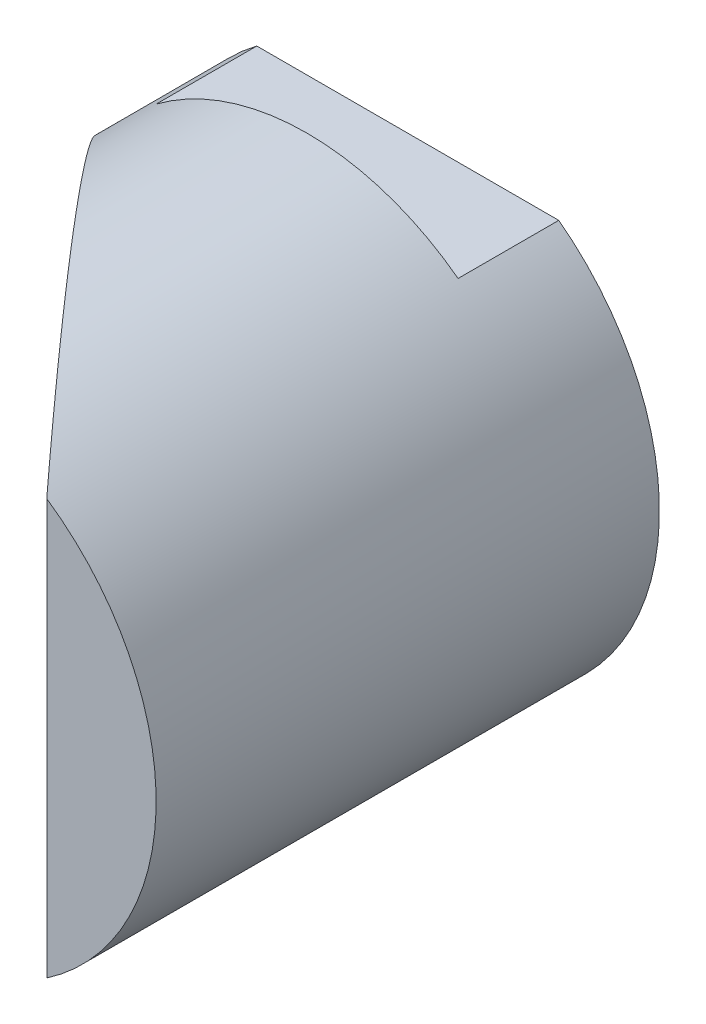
from build123d import *

# Parameters (mm, degrees)
SKETCH1_R               = 15.875
SKETCH1_R_2             = 4.3688
BOSS_EXTRUDE1_DEPTH     = 39.6875
CUT_EXTRUDE1_DEPTH      = 46.597466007
CUT_EXTRUDE1_DEPTH_BACK = 46.597466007
SKETCH3_W               = 40.65389326
SKETCH3_H               = 8.33800203
SKETCH3_H_2             = 7.923821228
CUT_EXTRUDE2_DEPTH      = 6.35
CUT_EXTRUDE3_DEPTH      = 46.597466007
CUT_EXTRUDE3_DEPTH_BACK = 46.597466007
SKETCH4_W               = 55.462368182
SKETCH4_H               = 18.061202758


with BuildPart() as part:
    # Sketch1 → Boss-Extrude1 (new body)
    with BuildSketch(Plane.XY):
        with Locations(Location((0, 0, 0), (0, 0, 180))):
            Circle(SKETCH1_R)
        with Locations(Location((0, 0, 0), (0, 0, 180))):
            Circle(SKETCH1_R_2, mode=Mode.SUBTRACT)
    extrude(amount=BOSS_EXTRUDE1_DEPTH)

    # Sketch2 → Cut-Extrude1 (cut, two sides: drawn at the far end of the back side and taken through both)
    with BuildSketch(Plane(origin=(0, 0, 0), x_dir=(1, 0, 0), z_dir=(0, 1, 0)).offset(-CUT_EXTRUDE1_DEPTH_BACK)):
        Polygon((15.875, -39.6875), (-25.928900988, 8.402386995), (-25.928900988, -39.6875), align=None)
    extrude(amount=CUT_EXTRUDE1_DEPTH + CUT_EXTRUDE1_DEPTH_BACK, mode=Mode.SUBTRACT)

    # Sketch3 → Cut-Extrude2 (cut)
    with BuildSketch(Plane.XY):
        with Locations((0, 16.869001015)):
            Rectangle(SKETCH3_W, SKETCH3_H)
        with Locations((0, -16.661910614)):
            Rectangle(SKETCH3_W, SKETCH3_H_2)
    extrude(amount=CUT_EXTRUDE2_DEPTH, mode=Mode.SUBTRACT)

    # Sketch4 → Cut-Extrude3 (cut, two sides: drawn at the far end of the back side and taken through both)
    with BuildSketch(Plane(origin=(0, 0, 0), x_dir=(1, 0, 0), z_dir=(0, 1, 0)).offset(-CUT_EXTRUDE3_DEPTH_BACK)):
        with Locations((1.101115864, -40.780601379)):
            Rectangle(SKETCH4_W, SKETCH4_H)
    extrude(amount=CUT_EXTRUDE3_DEPTH + CUT_EXTRUDE3_DEPTH_BACK, mode=Mode.SUBTRACT)


solid = part.part
